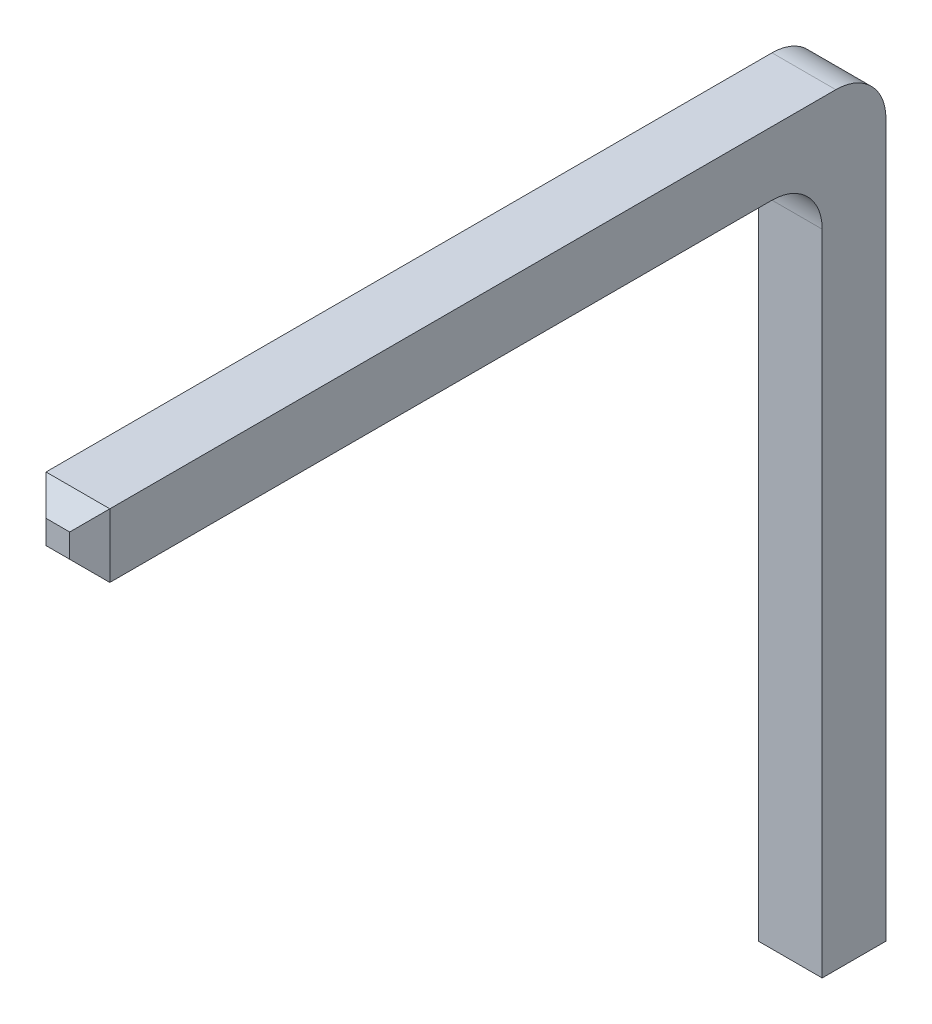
from build123d import *

# Parameters (mm, degrees)
CROQUIS1_W              = 0.636
CROQUIS1_H              = 0.636
SALIENTE_EXTRUIR1_DEPTH = 7.8
CROQUIS2_W              = 0.636
CROQUIS2_H              = 0.636
SALIENTE_EXTRUIR2_DEPTH = 7.3
REDONDEO1_R             = 0.5
CHAFL_N1_SIZE           = 0.2
CHAFL_N2_SIZE           = 0.2


with BuildPart() as part:
    # Croquis1 → Saliente-Extruir1 (new body)
    with BuildSketch(Plane(origin=(0, 0, 0), x_dir=(1, 0, 0), z_dir=(0, 1, 0))):
        with Locations((0.318, -0.318)):
            Rectangle(CROQUIS1_W, CROQUIS1_H)
    extrude(amount=SALIENTE_EXTRUIR1_DEPTH)

    # Croquis2 → Saliente-Extruir2 (add)
    with BuildSketch(Plane.XY.offset(0.636)):
        with Locations((0.318, 7.482)):
            Rectangle(CROQUIS2_W, CROQUIS2_H)
    extrude(amount=SALIENTE_EXTRUIR2_DEPTH)

    # Redondeo1
    redondeo1_edges = [part.edges().sort_by_distance(p)[0] for p in [
        (0.318, 7.164, 0.636),
        (0.318, 7.8, 0),
    ]]
    fillet(redondeo1_edges, radius=REDONDEO1_R)

    # Chafl_n1
    chafl_n1_edges = [part.edges().sort_by_distance(p)[0] for p in [
        (0.636, 7.482, 7.936),
        (0.318, 7.8, 7.936),
        (0, 7.482, 7.936),
        (0.318, 7.164, 7.936),
    ]]
    chamfer(chafl_n1_edges, length=CHAFL_N1_SIZE)

    # Chafl_n2
    chafl_n2_edges = [part.edges().sort_by_distance(p)[0] for p in [
        (0.318, 0, 0),
        (0.636, 0, 0.318),
        (0.318, 0, 0.636),
        (0, 0, 0.318),
    ]]
    chamfer(chafl_n2_edges, length=CHAFL_N2_SIZE)


solid = part.part
